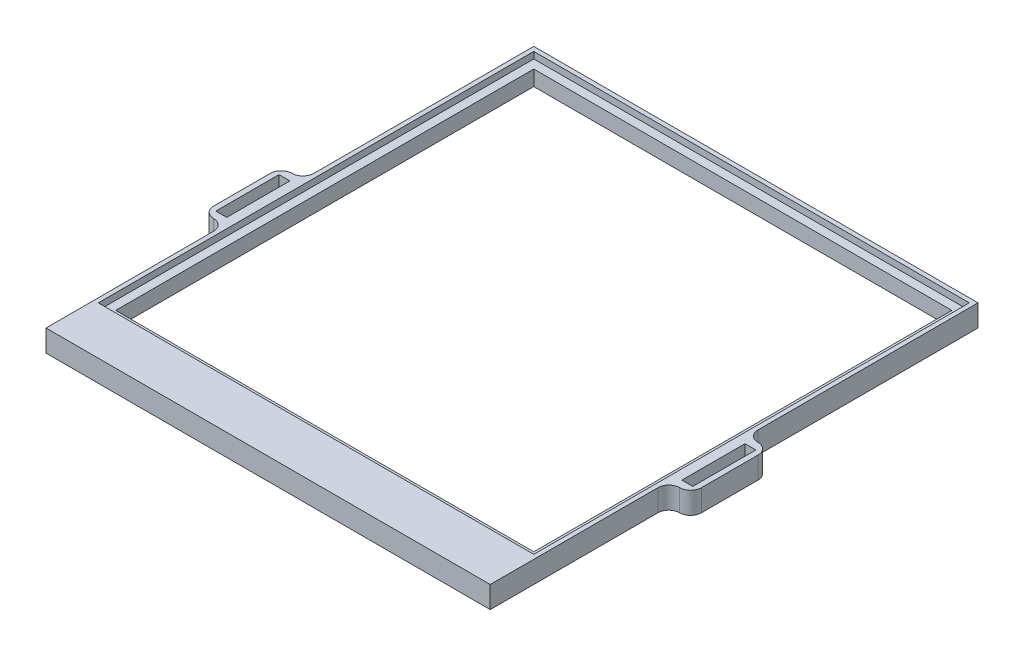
ISO-10303-21;
HEADER;
FILE_DESCRIPTION(('STEP AP214'),'2;1');
FILE_NAME('part.step','',(''),(''),'','','');
FILE_SCHEMA(('AUTOMOTIVE_DESIGN { 1 0 10303 214 1 1 1 1 }'));
ENDSEC;
DATA;
#1=APPLICATION_CONTEXT('core data for automotive mechanical design processes');
#2=APPLICATION_PROTOCOL_DEFINITION('international standard','automotive_design',2000,#1);
#3=PRODUCT_CONTEXT('',#1,'mechanical');
#4=PRODUCT('Part','Part','',(#3));
#5=PRODUCT_RELATED_PRODUCT_CATEGORY('part','',(#4));
#6=PRODUCT_DEFINITION_FORMATION('','',#4);
#7=PRODUCT_DEFINITION_CONTEXT('part definition',#1,'design');
#8=PRODUCT_DEFINITION('design','',#6,#7);
#9=PRODUCT_DEFINITION_SHAPE('','',#8);
#10=(LENGTH_UNIT() NAMED_UNIT(*) SI_UNIT(.MILLI.,.METRE.));
#11=(NAMED_UNIT(*) PLANE_ANGLE_UNIT() SI_UNIT($,.RADIAN.));
#12=(NAMED_UNIT(*) SI_UNIT($,.STERADIAN.) SOLID_ANGLE_UNIT());
#13=UNCERTAINTY_MEASURE_WITH_UNIT(LENGTH_MEASURE(1.E-05),#10,'distance_accuracy_value','');
#14=(GEOMETRIC_REPRESENTATION_CONTEXT(3) GLOBAL_UNCERTAINTY_ASSIGNED_CONTEXT((#13)) GLOBAL_UNIT_ASSIGNED_CONTEXT((#10,
#11,#12)) REPRESENTATION_CONTEXT('',''));
#15=CARTESIAN_POINT('',(0.,0.,0.));
#16=DIRECTION('',(0.,0.,1.));
#17=DIRECTION('',(1.,0.,0.));
#18=AXIS2_PLACEMENT_3D('',#15,#16,#17);
#19=CARTESIAN_POINT('',(51.,5.,-51.));
#20=DIRECTION('',(-1.,0.,0.));
#21=DIRECTION('',(0.,0.,1.));
#22=AXIS2_PLACEMENT_3D('',#19,#20,#21);
#23=PLANE('',#22);
#24=DIRECTION('',(0.,0.,-1.));
#25=VECTOR('',#24,1.);
#26=CARTESIAN_POINT('',(51.,0.,-51.));
#27=LINE('',#26,#25);
#28=CARTESIAN_POINT('',(51.,0.,61.));
#29=VERTEX_POINT('',#28);
#30=CARTESIAN_POINT('',(51.,0.,22.5));
#31=VERTEX_POINT('',#30);
#32=EDGE_CURVE('E455',#29,#31,#27,.T.);
#33=ORIENTED_EDGE('',*,*,#32,.T.);
#34=DIRECTION('',(0.,-1.,0.));
#35=VECTOR('',#34,1.);
#36=CARTESIAN_POINT('',(51.,5.,22.5));
#37=LINE('',#36,#35);
#38=CARTESIAN_POINT('',(51.,5.,22.5));
#39=VERTEX_POINT('',#38);
#40=EDGE_CURVE('E519',#31,#39,#37,.F.);
#41=ORIENTED_EDGE('',*,*,#40,.T.);
#42=DIRECTION('',(0.,0.,-1.));
#43=VECTOR('',#42,1.);
#44=CARTESIAN_POINT('',(51.,5.,-51.));
#45=LINE('',#44,#43);
#46=CARTESIAN_POINT('',(51.,5.,61.));
#47=VERTEX_POINT('',#46);
#48=EDGE_CURVE('E438',#47,#39,#45,.T.);
#49=ORIENTED_EDGE('',*,*,#48,.F.);
#50=DIRECTION('',(0.,-1.,0.));
#51=VECTOR('',#50,1.);
#52=CARTESIAN_POINT('',(51.,5.,61.));
#53=LINE('',#52,#51);
#54=EDGE_CURVE('E477',#47,#29,#53,.T.);
#55=ORIENTED_EDGE('',*,*,#54,.T.);
#56=EDGE_LOOP('',(#33,#41,#49,#55));
#57=FACE_BOUND('',#56,.T.);
#58=ADVANCED_FACE('F48',(#57),#23,.F.);
#59=CARTESIAN_POINT('',(-51.,5.,61.));
#60=DIRECTION('',(1.,0.,0.));
#61=DIRECTION('',(0.,0.,-1.));
#62=AXIS2_PLACEMENT_3D('',#59,#60,#61);
#63=PLANE('',#62);
#64=DIRECTION('',(0.,0.,1.));
#65=VECTOR('',#64,1.);
#66=CARTESIAN_POINT('',(-51.,0.,61.));
#67=LINE('',#66,#65);
#68=CARTESIAN_POINT('',(-51.,0.,-51.));
#69=VERTEX_POINT('',#68);
#70=CARTESIAN_POINT('',(-51.,0.,-0.500000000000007));
#71=VERTEX_POINT('',#70);
#72=EDGE_CURVE('E437',#69,#71,#67,.T.);
#73=ORIENTED_EDGE('',*,*,#72,.T.);
#74=DIRECTION('',(0.,-1.,0.));
#75=VECTOR('',#74,1.);
#76=CARTESIAN_POINT('',(-51.,5.,-0.500000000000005));
#77=LINE('',#76,#75);
#78=CARTESIAN_POINT('',(-51.,5.,-0.500000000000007));
#79=VERTEX_POINT('',#78);
#80=EDGE_CURVE('E522',#71,#79,#77,.F.);
#81=ORIENTED_EDGE('',*,*,#80,.T.);
#82=DIRECTION('',(0.,0.,1.));
#83=VECTOR('',#82,1.);
#84=CARTESIAN_POINT('',(-51.,5.,61.));
#85=LINE('',#84,#83);
#86=CARTESIAN_POINT('',(-51.,5.,-51.));
#87=VERTEX_POINT('',#86);
#88=EDGE_CURVE('E446',#87,#79,#85,.T.);
#89=ORIENTED_EDGE('',*,*,#88,.F.);
#90=DIRECTION('',(0.,-1.,0.));
#91=VECTOR('',#90,1.);
#92=CARTESIAN_POINT('',(-51.,5.,-51.));
#93=LINE('',#92,#91);
#94=EDGE_CURVE('E469',#87,#69,#93,.T.);
#95=ORIENTED_EDGE('',*,*,#94,.T.);
#96=EDGE_LOOP('',(#73,#81,#89,#95));
#97=FACE_BOUND('',#96,.T.);
#98=ADVANCED_FACE('F706',(#97),#63,.F.);
#99=CARTESIAN_POINT('',(48.,5.,48.));
#100=DIRECTION('',(-1.,0.,0.));
#101=DIRECTION('',(0.,0.,1.));
#102=AXIS2_PLACEMENT_3D('',#99,#100,#101);
#103=PLANE('',#102);
#104=DIRECTION('',(0.,-1.,0.));
#105=VECTOR('',#104,1.);
#106=CARTESIAN_POINT('',(48.,5.,48.));
#107=LINE('',#106,#105);
#108=CARTESIAN_POINT('',(48.,3.5,48.));
#109=VERTEX_POINT('',#108);
#110=CARTESIAN_POINT('',(48.,0.,48.));
#111=VERTEX_POINT('',#110);
#112=EDGE_CURVE('E419',#109,#111,#107,.T.);
#113=ORIENTED_EDGE('',*,*,#112,.F.);
#114=DIRECTION('',(0.,0.,-1.));
#115=VECTOR('',#114,1.);
#116=CARTESIAN_POINT('',(48.,3.5,48.));
#117=LINE('',#116,#115);
#118=CARTESIAN_POINT('',(48.,3.5,-48.));
#119=VERTEX_POINT('',#118);
#120=EDGE_CURVE('E399',#109,#119,#117,.T.);
#121=ORIENTED_EDGE('',*,*,#120,.T.);
#122=DIRECTION('',(0.,-1.,0.));
#123=VECTOR('',#122,1.);
#124=CARTESIAN_POINT('',(48.,5.,-48.));
#125=LINE('',#124,#123);
#126=CARTESIAN_POINT('',(48.,0.,-48.));
#127=VERTEX_POINT('',#126);
#128=EDGE_CURVE('E428',#119,#127,#125,.T.);
#129=ORIENTED_EDGE('',*,*,#128,.T.);
#130=DIRECTION('',(0.,0.,-1.));
#131=VECTOR('',#130,1.);
#132=CARTESIAN_POINT('',(48.,0.,48.));
#133=LINE('',#132,#131);
#134=EDGE_CURVE('E403',#111,#127,#133,.T.);
#135=ORIENTED_EDGE('',*,*,#134,.F.);
#136=EDGE_LOOP('',(#113,#121,#129,#135));
#137=FACE_BOUND('',#136,.T.);
#138=ADVANCED_FACE('F713',(#137),#103,.T.);
#139=CARTESIAN_POINT('',(-48.,5.,-48.));
#140=DIRECTION('',(0.,0.,1.));
#141=DIRECTION('',(1.,0.,0.));
#142=AXIS2_PLACEMENT_3D('',#139,#140,#141);
#143=PLANE('',#142);
#144=ORIENTED_EDGE('',*,*,#128,.F.);
#145=DIRECTION('',(-1.,0.,0.));
#146=VECTOR('',#145,1.);
#147=CARTESIAN_POINT('',(-48.,3.5,-48.));
#148=LINE('',#147,#146);
#149=CARTESIAN_POINT('',(-48.,3.5,-48.));
#150=VERTEX_POINT('',#149);
#151=EDGE_CURVE('E395',#119,#150,#148,.T.);
#152=ORIENTED_EDGE('',*,*,#151,.T.);
#153=DIRECTION('',(0.,-1.,0.));
#154=VECTOR('',#153,1.);
#155=CARTESIAN_POINT('',(-48.,5.,-48.));
#156=LINE('',#155,#154);
#157=CARTESIAN_POINT('',(-48.,0.,-48.));
#158=VERTEX_POINT('',#157);
#159=EDGE_CURVE('E425',#150,#158,#156,.T.);
#160=ORIENTED_EDGE('',*,*,#159,.T.);
#161=DIRECTION('',(-1.,0.,0.));
#162=VECTOR('',#161,1.);
#163=CARTESIAN_POINT('',(-48.,0.,-48.));
#164=LINE('',#163,#162);
#165=EDGE_CURVE('E407',#127,#158,#164,.T.);
#166=ORIENTED_EDGE('',*,*,#165,.F.);
#167=EDGE_LOOP('',(#144,#152,#160,#166));
#168=FACE_BOUND('',#167,.T.);
#169=ADVANCED_FACE('F1142',(#168),#143,.T.);
#170=CARTESIAN_POINT('',(-48.,5.,48.));
#171=DIRECTION('',(1.,0.,0.));
#172=DIRECTION('',(0.,0.,-1.));
#173=AXIS2_PLACEMENT_3D('',#170,#171,#172);
#174=PLANE('',#173);
#175=ORIENTED_EDGE('',*,*,#159,.F.);
#176=DIRECTION('',(0.,0.,1.));
#177=VECTOR('',#176,1.);
#178=CARTESIAN_POINT('',(-48.,3.5,48.));
#179=LINE('',#178,#177);
#180=CARTESIAN_POINT('',(-48.,3.5,48.));
#181=VERTEX_POINT('',#180);
#182=EDGE_CURVE('E382',#150,#181,#179,.T.);
#183=ORIENTED_EDGE('',*,*,#182,.T.);
#184=DIRECTION('',(0.,-1.,0.));
#185=VECTOR('',#184,1.);
#186=CARTESIAN_POINT('',(-48.,5.,48.));
#187=LINE('',#186,#185);
#188=CARTESIAN_POINT('',(-48.,0.,48.));
#189=VERTEX_POINT('',#188);
#190=EDGE_CURVE('E422',#181,#189,#187,.T.);
#191=ORIENTED_EDGE('',*,*,#190,.T.);
#192=DIRECTION('',(0.,0.,1.));
#193=VECTOR('',#192,1.);
#194=CARTESIAN_POINT('',(-48.,0.,48.));
#195=LINE('',#194,#193);
#196=EDGE_CURVE('E411',#158,#189,#195,.T.);
#197=ORIENTED_EDGE('',*,*,#196,.F.);
#198=EDGE_LOOP('',(#175,#183,#191,#197));
#199=FACE_BOUND('',#198,.T.);
#200=ADVANCED_FACE('F1133',(#199),#174,.T.);
#201=CARTESIAN_POINT('',(-48.,5.,48.));
#202=DIRECTION('',(0.,0.,-1.));
#203=DIRECTION('',(-1.,0.,0.));
#204=AXIS2_PLACEMENT_3D('',#201,#202,#203);
#205=PLANE('',#204);
#206=ORIENTED_EDGE('',*,*,#190,.F.);
#207=DIRECTION('',(1.,0.,0.));
#208=VECTOR('',#207,1.);
#209=CARTESIAN_POINT('',(-48.,3.5,48.));
#210=LINE('',#209,#208);
#211=EDGE_CURVE('E481',#181,#109,#210,.T.);
#212=ORIENTED_EDGE('',*,*,#211,.T.);
#213=ORIENTED_EDGE('',*,*,#112,.T.);
#214=DIRECTION('',(1.,0.,0.));
#215=VECTOR('',#214,1.);
#216=CARTESIAN_POINT('',(-48.,0.,48.));
#217=LINE('',#216,#215);
#218=EDGE_CURVE('E415',#189,#111,#217,.T.);
#219=ORIENTED_EDGE('',*,*,#218,.F.);
#220=EDGE_LOOP('',(#206,#212,#213,#219));
#221=FACE_BOUND('',#220,.T.);
#222=ADVANCED_FACE('F992',(#221),#205,.T.);
#223=CARTESIAN_POINT('',(0.,5.,0.));
#224=DIRECTION('',(0.,-1.,0.));
#225=DIRECTION('',(0.,0.,-1.));
#226=AXIS2_PLACEMENT_3D('',#223,#224,#225);
#227=PLANE('',#226);
#228=DIRECTION('',(-1.,0.,0.));
#229=VECTOR('',#228,1.);
#230=CARTESIAN_POINT('',(0.,5.,-50.));
#231=LINE('',#230,#229);
#232=CARTESIAN_POINT('',(50.,5.,-50.));
#233=VERTEX_POINT('',#232);
#234=CARTESIAN_POINT('',(-50.,5.,-50.));
#235=VERTEX_POINT('',#234);
#236=EDGE_CURVE('E368',#233,#235,#231,.T.);
#237=ORIENTED_EDGE('',*,*,#236,.F.);
#238=DIRECTION('',(0.,0.,-1.));
#239=VECTOR('',#238,1.);
#240=CARTESIAN_POINT('',(50.,5.,0.));
#241=LINE('',#240,#239);
#242=CARTESIAN_POINT('',(50.,5.,50.));
#243=VERTEX_POINT('',#242);
#244=EDGE_CURVE('E345',#243,#233,#241,.T.);
#245=ORIENTED_EDGE('',*,*,#244,.F.);
#246=DIRECTION('',(1.,0.,0.));
#247=VECTOR('',#246,1.);
#248=CARTESIAN_POINT('',(0.,5.,50.));
#249=LINE('',#248,#247);
#250=CARTESIAN_POINT('',(-50.,5.,50.));
#251=VERTEX_POINT('',#250);
#252=EDGE_CURVE('E353',#251,#243,#249,.T.);
#253=ORIENTED_EDGE('',*,*,#252,.F.);
#254=DIRECTION('',(0.,0.,1.));
#255=VECTOR('',#254,1.);
#256=CARTESIAN_POINT('',(-50.,5.,0.));
#257=LINE('',#256,#255);
#258=EDGE_CURVE('E372',#235,#251,#257,.T.);
#259=ORIENTED_EDGE('',*,*,#258,.F.);
#260=EDGE_LOOP('',(#237,#245,#253,#259));
#261=FACE_BOUND('',#260,.T.);
#262=DIRECTION('',(0.,0.,1.));
#263=VECTOR('',#262,1.);
#264=CARTESIAN_POINT('',(56.,5.,1.99999999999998));
#265=LINE('',#264,#263);
#266=CARTESIAN_POINT('',(56.,5.,4.49999999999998));
#267=VERTEX_POINT('',#266);
#268=CARTESIAN_POINT('',(56.,5.,17.5));
#269=VERTEX_POINT('',#268);
#270=EDGE_CURVE('E295',#267,#269,#265,.T.);
#271=ORIENTED_EDGE('',*,*,#270,.F.);
#272=CARTESIAN_POINT('',(53.5,5.,4.49999999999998));
#273=DIRECTION('',(0.,-1.,0.));
#274=DIRECTION('',(0.,0.,-1.));
#275=AXIS2_PLACEMENT_3D('',#272,#273,#274);
#276=CIRCLE('',#275,2.5);
#277=CARTESIAN_POINT('',(53.5,5.,1.99999999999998));
#278=VERTEX_POINT('',#277);
#279=EDGE_CURVE('E516',#267,#278,#276,.F.);
#280=ORIENTED_EDGE('',*,*,#279,.T.);
#281=CARTESIAN_POINT('',(53.5,5.,-0.500000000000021));
#282=DIRECTION('',(0.,-1.,0.));
#283=DIRECTION('',(0.,0.,-1.));
#284=AXIS2_PLACEMENT_3D('',#281,#282,#283);
#285=CIRCLE('',#284,2.5);
#286=CARTESIAN_POINT('',(51.,5.,-0.500000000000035));
#287=VERTEX_POINT('',#286);
#288=EDGE_CURVE('E539',#278,#287,#285,.T.);
#289=ORIENTED_EDGE('',*,*,#288,.T.);
#290=CARTESIAN_POINT('',(51.,5.,-51.));
#291=VERTEX_POINT('',#290);
#292=EDGE_CURVE('E436',#287,#291,#45,.T.);
#293=ORIENTED_EDGE('',*,*,#292,.T.);
#294=DIRECTION('',(-1.,0.,0.));
#295=VECTOR('',#294,1.);
#296=CARTESIAN_POINT('',(-51.,5.,-51.));
#297=LINE('',#296,#295);
#298=EDGE_CURVE('E442',#291,#87,#297,.T.);
#299=ORIENTED_EDGE('',*,*,#298,.T.);
#300=ORIENTED_EDGE('',*,*,#88,.T.);
#301=CARTESIAN_POINT('',(-53.5,5.,-0.500000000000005));
#302=DIRECTION('',(0.,-1.,0.));
#303=DIRECTION('',(0.,0.,-1.));
#304=AXIS2_PLACEMENT_3D('',#301,#302,#303);
#305=CIRCLE('',#304,2.5);
#306=CARTESIAN_POINT('',(-53.5,5.,1.99999999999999));
#307=VERTEX_POINT('',#306);
#308=EDGE_CURVE('E551',#79,#307,#305,.T.);
#309=ORIENTED_EDGE('',*,*,#308,.T.);
#310=CARTESIAN_POINT('',(-53.5,5.,4.49999999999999));
#311=DIRECTION('',(0.,-1.,0.));
#312=DIRECTION('',(0.,0.,-1.));
#313=AXIS2_PLACEMENT_3D('',#310,#311,#312);
#314=CIRCLE('',#313,2.5);
#315=CARTESIAN_POINT('',(-56.,5.,4.49999999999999));
#316=VERTEX_POINT('',#315);
#317=EDGE_CURVE('E510',#307,#316,#314,.F.);
#318=ORIENTED_EDGE('',*,*,#317,.T.);
#319=DIRECTION('',(0.,0.,-1.));
#320=VECTOR('',#319,1.);
#321=CARTESIAN_POINT('',(-56.,5.,1.99999999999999));
#322=LINE('',#321,#320);
#323=CARTESIAN_POINT('',(-56.,5.,17.5));
#324=VERTEX_POINT('',#323);
#325=EDGE_CURVE('E305',#324,#316,#322,.T.);
#326=ORIENTED_EDGE('',*,*,#325,.F.);
#327=CARTESIAN_POINT('',(-53.5,5.,17.5));
#328=DIRECTION('',(0.,-1.,0.));
#329=DIRECTION('',(0.,0.,-1.));
#330=AXIS2_PLACEMENT_3D('',#327,#328,#329);
#331=CIRCLE('',#330,2.5);
#332=CARTESIAN_POINT('',(-53.5,5.,20.));
#333=VERTEX_POINT('',#332);
#334=EDGE_CURVE('E69',#324,#333,#331,.F.);
#335=ORIENTED_EDGE('',*,*,#334,.T.);
#336=CARTESIAN_POINT('',(-53.5,5.,22.5));
#337=DIRECTION('',(0.,-1.,0.));
#338=DIRECTION('',(0.,0.,-1.));
#339=AXIS2_PLACEMENT_3D('',#336,#337,#338);
#340=CIRCLE('',#339,2.5);
#341=CARTESIAN_POINT('',(-51.,5.,22.5));
#342=VERTEX_POINT('',#341);
#343=EDGE_CURVE('E11',#333,#342,#340,.T.);
#344=ORIENTED_EDGE('',*,*,#343,.T.);
#345=CARTESIAN_POINT('',(-51.,5.,61.));
#346=VERTEX_POINT('',#345);
#347=EDGE_CURVE('E445',#342,#346,#85,.T.);
#348=ORIENTED_EDGE('',*,*,#347,.T.);
#349=DIRECTION('',(1.,0.,0.));
#350=VECTOR('',#349,1.);
#351=CARTESIAN_POINT('',(51.,5.,61.));
#352=LINE('',#351,#350);
#353=EDGE_CURVE('E432',#346,#47,#352,.T.);
#354=ORIENTED_EDGE('',*,*,#353,.T.);
#355=ORIENTED_EDGE('',*,*,#48,.T.);
#356=CARTESIAN_POINT('',(53.5,5.,22.5));
#357=DIRECTION('',(0.,-1.,0.));
#358=DIRECTION('',(0.,0.,-1.));
#359=AXIS2_PLACEMENT_3D('',#356,#357,#358);
#360=CIRCLE('',#359,2.5);
#361=CARTESIAN_POINT('',(53.5,5.,20.));
#362=VERTEX_POINT('',#361);
#363=EDGE_CURVE('E545',#39,#362,#360,.T.);
#364=ORIENTED_EDGE('',*,*,#363,.T.);
#365=CARTESIAN_POINT('',(53.5,5.,17.5));
#366=DIRECTION('',(0.,-1.,0.));
#367=DIRECTION('',(0.,0.,-1.));
#368=AXIS2_PLACEMENT_3D('',#365,#366,#367);
#369=CIRCLE('',#368,2.5);
#370=EDGE_CURVE('E513',#362,#269,#369,.F.);
#371=ORIENTED_EDGE('',*,*,#370,.T.);
#372=EDGE_LOOP('',(#271,#280,#289,#293,#299,#300,#309,#318,#326,#335,#344,#348,#354,#355,#364,#371));
#373=FACE_BOUND('',#372,.T.);
#374=DIRECTION('',(0.,0.,-1.));
#375=VECTOR('',#374,1.);
#376=CARTESIAN_POINT('',(-54.75,5.,18.25));
#377=LINE('',#376,#375);
#378=CARTESIAN_POINT('',(-54.75,5.,18.25));
#379=VERTEX_POINT('',#378);
#380=CARTESIAN_POINT('',(-54.75,5.00000000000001,3.75));
#381=VERTEX_POINT('',#380);
#382=EDGE_CURVE('E325',#379,#381,#377,.T.);
#383=ORIENTED_EDGE('',*,*,#382,.T.);
#384=DIRECTION('',(1.,0.,0.));
#385=VECTOR('',#384,1.);
#386=CARTESIAN_POINT('',(-54.75,5.,3.75));
#387=LINE('',#386,#385);
#388=CARTESIAN_POINT('',(-52.25,5.,3.75000000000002));
#389=VERTEX_POINT('',#388);
#390=EDGE_CURVE('E321',#381,#389,#387,.T.);
#391=ORIENTED_EDGE('',*,*,#390,.T.);
#392=DIRECTION('',(0.,0.,1.));
#393=VECTOR('',#392,1.);
#394=CARTESIAN_POINT('',(-52.25,5.,18.25));
#395=LINE('',#394,#393);
#396=CARTESIAN_POINT('',(-52.25,5.,18.25));
#397=VERTEX_POINT('',#396);
#398=EDGE_CURVE('E324',#389,#397,#395,.T.);
#399=ORIENTED_EDGE('',*,*,#398,.T.);
#400=DIRECTION('',(-1.,0.,0.));
#401=VECTOR('',#400,1.);
#402=CARTESIAN_POINT('',(-54.75,5.,18.25));
#403=LINE('',#402,#401);
#404=EDGE_CURVE('E342',#397,#379,#403,.T.);
#405=ORIENTED_EDGE('',*,*,#404,.T.);
#406=EDGE_LOOP('',(#383,#391,#399,#405));
#407=FACE_BOUND('',#406,.T.);
#408=DIRECTION('',(-1.,0.,0.));
#409=VECTOR('',#408,1.);
#410=CARTESIAN_POINT('',(54.75,5.,18.25));
#411=LINE('',#410,#409);
#412=CARTESIAN_POINT('',(54.75,5.,18.25));
#413=VERTEX_POINT('',#412);
#414=CARTESIAN_POINT('',(52.25,5.00000000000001,18.25));
#415=VERTEX_POINT('',#414);
#416=EDGE_CURVE('E264',#413,#415,#411,.T.);
#417=ORIENTED_EDGE('',*,*,#416,.T.);
#418=DIRECTION('',(0.,0.,-1.));
#419=VECTOR('',#418,1.);
#420=CARTESIAN_POINT('',(52.25,5.,18.25));
#421=LINE('',#420,#419);
#422=CARTESIAN_POINT('',(52.25,5.,3.75000000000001));
#423=VERTEX_POINT('',#422);
#424=EDGE_CURVE('E292',#415,#423,#421,.T.);
#425=ORIENTED_EDGE('',*,*,#424,.T.);
#426=DIRECTION('',(1.,0.,0.));
#427=VECTOR('',#426,1.);
#428=CARTESIAN_POINT('',(54.75,5.,3.75000000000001));
#429=LINE('',#428,#427);
#430=CARTESIAN_POINT('',(54.75,5.,3.75000000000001));
#431=VERTEX_POINT('',#430);
#432=EDGE_CURVE('E671',#423,#431,#429,.T.);
#433=ORIENTED_EDGE('',*,*,#432,.T.);
#434=DIRECTION('',(0.,0.,1.));
#435=VECTOR('',#434,1.);
#436=CARTESIAN_POINT('',(54.75,5.,18.25));
#437=LINE('',#436,#435);
#438=EDGE_CURVE('E560',#431,#413,#437,.T.);
#439=ORIENTED_EDGE('',*,*,#438,.T.);
#440=EDGE_LOOP('',(#417,#425,#433,#439));
#441=FACE_BOUND('',#440,.T.);
#442=ADVANCED_FACE('F685',(#261,#373,#407,#441),#227,.F.);
#443=CARTESIAN_POINT('',(0.,0.,0.));
#444=DIRECTION('',(0.,-1.,0.));
#445=DIRECTION('',(0.,0.,-1.));
#446=AXIS2_PLACEMENT_3D('',#443,#444,#445);
#447=PLANE('',#446);
#448=CARTESIAN_POINT('',(51.,0.,-0.500000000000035));
#449=VERTEX_POINT('',#448);
#450=CARTESIAN_POINT('',(51.,0.,-51.));
#451=VERTEX_POINT('',#450);
#452=EDGE_CURVE('E454',#449,#451,#27,.T.);
#453=ORIENTED_EDGE('',*,*,#452,.F.);
#454=CARTESIAN_POINT('',(53.5,0.,-0.500000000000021));
#455=DIRECTION('',(0.,-1.,0.));
#456=DIRECTION('',(0.,0.,-1.));
#457=AXIS2_PLACEMENT_3D('',#454,#455,#456);
#458=CIRCLE('',#457,2.5);
#459=CARTESIAN_POINT('',(53.5,0.,1.99999999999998));
#460=VERTEX_POINT('',#459);
#461=EDGE_CURVE('E536',#449,#460,#458,.F.);
#462=ORIENTED_EDGE('',*,*,#461,.T.);
#463=CARTESIAN_POINT('',(53.5,0.,4.49999999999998));
#464=DIRECTION('',(0.,-1.,0.));
#465=DIRECTION('',(0.,0.,-1.));
#466=AXIS2_PLACEMENT_3D('',#463,#464,#465);
#467=CIRCLE('',#466,2.5);
#468=CARTESIAN_POINT('',(56.,0.,4.49999999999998));
#469=VERTEX_POINT('',#468);
#470=EDGE_CURVE('E498',#460,#469,#467,.T.);
#471=ORIENTED_EDGE('',*,*,#470,.T.);
#472=DIRECTION('',(0.,0.,-1.));
#473=VECTOR('',#472,1.);
#474=CARTESIAN_POINT('',(56.,0.,1.99999999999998));
#475=LINE('',#474,#473);
#476=CARTESIAN_POINT('',(56.,0.,17.5));
#477=VERTEX_POINT('',#476);
#478=EDGE_CURVE('E268',#477,#469,#475,.T.);
#479=ORIENTED_EDGE('',*,*,#478,.F.);
#480=CARTESIAN_POINT('',(53.5,0.,17.5));
#481=DIRECTION('',(0.,-1.,0.));
#482=DIRECTION('',(0.,0.,-1.));
#483=AXIS2_PLACEMENT_3D('',#480,#481,#482);
#484=CIRCLE('',#483,2.5);
#485=CARTESIAN_POINT('',(53.5,0.,20.));
#486=VERTEX_POINT('',#485);
#487=EDGE_CURVE('E495',#477,#486,#484,.T.);
#488=ORIENTED_EDGE('',*,*,#487,.T.);
#489=CARTESIAN_POINT('',(53.5,0.,22.5));
#490=DIRECTION('',(0.,-1.,0.));
#491=DIRECTION('',(0.,0.,-1.));
#492=AXIS2_PLACEMENT_3D('',#489,#490,#491);
#493=CIRCLE('',#492,2.5);
#494=EDGE_CURVE('E542',#486,#31,#493,.F.);
#495=ORIENTED_EDGE('',*,*,#494,.T.);
#496=ORIENTED_EDGE('',*,*,#32,.F.);
#497=DIRECTION('',(1.,0.,0.));
#498=VECTOR('',#497,1.);
#499=CARTESIAN_POINT('',(51.,0.,61.));
#500=LINE('',#499,#498);
#501=CARTESIAN_POINT('',(-51.,0.,61.));
#502=VERTEX_POINT('',#501);
#503=EDGE_CURVE('E431',#502,#29,#500,.T.);
#504=ORIENTED_EDGE('',*,*,#503,.F.);
#505=CARTESIAN_POINT('',(-51.,0.,22.5));
#506=VERTEX_POINT('',#505);
#507=EDGE_CURVE('E462',#506,#502,#67,.T.);
#508=ORIENTED_EDGE('',*,*,#507,.F.);
#509=CARTESIAN_POINT('',(-53.5,0.,22.5));
#510=DIRECTION('',(0.,-1.,0.));
#511=DIRECTION('',(0.,0.,-1.));
#512=AXIS2_PLACEMENT_3D('',#509,#510,#511);
#513=CIRCLE('',#512,2.5);
#514=CARTESIAN_POINT('',(-53.5,0.,20.));
#515=VERTEX_POINT('',#514);
#516=EDGE_CURVE('E58',#506,#515,#513,.F.);
#517=ORIENTED_EDGE('',*,*,#516,.T.);
#518=CARTESIAN_POINT('',(-53.5,0.,17.5));
#519=DIRECTION('',(0.,-1.,0.));
#520=DIRECTION('',(0.,0.,-1.));
#521=AXIS2_PLACEMENT_3D('',#518,#519,#520);
#522=CIRCLE('',#521,2.5);
#523=CARTESIAN_POINT('',(-56.,0.,17.5));
#524=VERTEX_POINT('',#523);
#525=EDGE_CURVE('E489',#515,#524,#522,.T.);
#526=ORIENTED_EDGE('',*,*,#525,.T.);
#527=DIRECTION('',(0.,0.,1.));
#528=VECTOR('',#527,1.);
#529=CARTESIAN_POINT('',(-56.,0.,1.99999999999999));
#530=LINE('',#529,#528);
#531=CARTESIAN_POINT('',(-56.,0.,4.49999999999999));
#532=VERTEX_POINT('',#531);
#533=EDGE_CURVE('E300',#532,#524,#530,.T.);
#534=ORIENTED_EDGE('',*,*,#533,.F.);
#535=CARTESIAN_POINT('',(-53.5,0.,4.49999999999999));
#536=DIRECTION('',(0.,-1.,0.));
#537=DIRECTION('',(0.,0.,-1.));
#538=AXIS2_PLACEMENT_3D('',#535,#536,#537);
#539=CIRCLE('',#538,2.5);
#540=CARTESIAN_POINT('',(-53.5,0.,1.99999999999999));
#541=VERTEX_POINT('',#540);
#542=EDGE_CURVE('E492',#532,#541,#539,.T.);
#543=ORIENTED_EDGE('',*,*,#542,.T.);
#544=CARTESIAN_POINT('',(-53.5,0.,-0.500000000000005));
#545=DIRECTION('',(0.,-1.,0.));
#546=DIRECTION('',(0.,0.,-1.));
#547=AXIS2_PLACEMENT_3D('',#544,#545,#546);
#548=CIRCLE('',#547,2.5);
#549=EDGE_CURVE('E548',#541,#71,#548,.F.);
#550=ORIENTED_EDGE('',*,*,#549,.T.);
#551=ORIENTED_EDGE('',*,*,#72,.F.);
#552=DIRECTION('',(-1.,0.,0.));
#553=VECTOR('',#552,1.);
#554=CARTESIAN_POINT('',(-51.,0.,-51.));
#555=LINE('',#554,#553);
#556=EDGE_CURVE('E459',#451,#69,#555,.T.);
#557=ORIENTED_EDGE('',*,*,#556,.F.);
#558=EDGE_LOOP('',(#453,#462,#471,#479,#488,#495,#496,#504,#508,#517,#526,#534,#543,#550,#551,#557));
#559=FACE_BOUND('',#558,.T.);
#560=ORIENTED_EDGE('',*,*,#218,.T.);
#561=ORIENTED_EDGE('',*,*,#134,.T.);
#562=ORIENTED_EDGE('',*,*,#165,.T.);
#563=ORIENTED_EDGE('',*,*,#196,.T.);
#564=EDGE_LOOP('',(#560,#561,#562,#563));
#565=FACE_BOUND('',#564,.T.);
#566=DIRECTION('',(0.,0.,1.));
#567=VECTOR('',#566,1.);
#568=CARTESIAN_POINT('',(-54.75,0.,18.25));
#569=LINE('',#568,#567);
#570=CARTESIAN_POINT('',(-54.75,0.,3.75));
#571=VERTEX_POINT('',#570);
#572=CARTESIAN_POINT('',(-54.75,0.,18.25));
#573=VERTEX_POINT('',#572);
#574=EDGE_CURVE('E289',#571,#573,#569,.T.);
#575=ORIENTED_EDGE('',*,*,#574,.T.);
#576=DIRECTION('',(1.,0.,0.));
#577=VECTOR('',#576,1.);
#578=CARTESIAN_POINT('',(-54.75,0.,18.25));
#579=LINE('',#578,#577);
#580=CARTESIAN_POINT('',(-52.25,0.,18.25));
#581=VERTEX_POINT('',#580);
#582=EDGE_CURVE('E314',#573,#581,#579,.T.);
#583=ORIENTED_EDGE('',*,*,#582,.T.);
#584=DIRECTION('',(0.,0.,-1.));
#585=VECTOR('',#584,1.);
#586=CARTESIAN_POINT('',(-52.25,0.,18.25));
#587=LINE('',#586,#585);
#588=CARTESIAN_POINT('',(-52.25,0.,3.75000000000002));
#589=VERTEX_POINT('',#588);
#590=EDGE_CURVE('E310',#581,#589,#587,.T.);
#591=ORIENTED_EDGE('',*,*,#590,.T.);
#592=DIRECTION('',(-1.,0.,0.));
#593=VECTOR('',#592,1.);
#594=CARTESIAN_POINT('',(-54.75,0.,3.75));
#595=LINE('',#594,#593);
#596=EDGE_CURVE('E306',#589,#571,#595,.T.);
#597=ORIENTED_EDGE('',*,*,#596,.T.);
#598=EDGE_LOOP('',(#575,#583,#591,#597));
#599=FACE_BOUND('',#598,.T.);
#600=DIRECTION('',(0.,0.,1.));
#601=VECTOR('',#600,1.);
#602=CARTESIAN_POINT('',(52.25,0.,18.25));
#603=LINE('',#602,#601);
#604=CARTESIAN_POINT('',(52.25,0.,3.75000000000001));
#605=VERTEX_POINT('',#604);
#606=CARTESIAN_POINT('',(52.25,0.,18.25));
#607=VERTEX_POINT('',#606);
#608=EDGE_CURVE('E283',#605,#607,#603,.T.);
#609=ORIENTED_EDGE('',*,*,#608,.T.);
#610=DIRECTION('',(1.,0.,0.));
#611=VECTOR('',#610,1.);
#612=CARTESIAN_POINT('',(54.75,0.,18.25));
#613=LINE('',#612,#611);
#614=CARTESIAN_POINT('',(54.75,0.,18.25));
#615=VERTEX_POINT('',#614);
#616=EDGE_CURVE('E262',#607,#615,#613,.T.);
#617=ORIENTED_EDGE('',*,*,#616,.T.);
#618=DIRECTION('',(0.,0.,-1.));
#619=VECTOR('',#618,1.);
#620=CARTESIAN_POINT('',(54.75,0.,18.25));
#621=LINE('',#620,#619);
#622=CARTESIAN_POINT('',(54.75,0.,3.75000000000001));
#623=VERTEX_POINT('',#622);
#624=EDGE_CURVE('E272',#615,#623,#621,.T.);
#625=ORIENTED_EDGE('',*,*,#624,.T.);
#626=DIRECTION('',(-1.,0.,0.));
#627=VECTOR('',#626,1.);
#628=CARTESIAN_POINT('',(54.75,0.,3.75000000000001));
#629=LINE('',#628,#627);
#630=EDGE_CURVE('E279',#623,#605,#629,.T.);
#631=ORIENTED_EDGE('',*,*,#630,.T.);
#632=EDGE_LOOP('',(#609,#617,#625,#631));
#633=FACE_BOUND('',#632,.T.);
#634=ADVANCED_FACE('F281',(#559,#565,#599,#633),#447,.T.);
#635=CARTESIAN_POINT('',(51.,5.,61.));
#636=DIRECTION('',(0.,0.,-1.));
#637=DIRECTION('',(-1.,0.,0.));
#638=AXIS2_PLACEMENT_3D('',#635,#636,#637);
#639=PLANE('',#638);
#640=ORIENTED_EDGE('',*,*,#503,.T.);
#641=ORIENTED_EDGE('',*,*,#54,.F.);
#642=ORIENTED_EDGE('',*,*,#353,.F.);
#643=DIRECTION('',(0.,-1.,0.));
#644=VECTOR('',#643,1.);
#645=CARTESIAN_POINT('',(-51.,5.,61.));
#646=LINE('',#645,#644);
#647=EDGE_CURVE('E450',#346,#502,#646,.T.);
#648=ORIENTED_EDGE('',*,*,#647,.T.);
#649=EDGE_LOOP('',(#640,#641,#642,#648));
#650=FACE_BOUND('',#649,.T.);
#651=ADVANCED_FACE('F720',(#650),#639,.F.);
#652=ORIENTED_EDGE('',*,*,#292,.F.);
#653=DIRECTION('',(0.,-1.,0.));
#654=VECTOR('',#653,1.);
#655=CARTESIAN_POINT('',(51.,0.,-0.500000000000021));
#656=LINE('',#655,#654);
#657=EDGE_CURVE('E485',#287,#449,#656,.T.);
#658=ORIENTED_EDGE('',*,*,#657,.T.);
#659=ORIENTED_EDGE('',*,*,#452,.T.);
#660=DIRECTION('',(0.,-1.,0.));
#661=VECTOR('',#660,1.);
#662=CARTESIAN_POINT('',(51.,5.,-51.));
#663=LINE('',#662,#661);
#664=EDGE_CURVE('E473',#291,#451,#663,.T.);
#665=ORIENTED_EDGE('',*,*,#664,.F.);
#666=EDGE_LOOP('',(#652,#658,#659,#665));
#667=FACE_BOUND('',#666,.T.);
#668=ADVANCED_FACE('F709',(#667),#23,.F.);
#669=CARTESIAN_POINT('',(-51.,5.,-51.));
#670=DIRECTION('',(0.,0.,1.));
#671=DIRECTION('',(1.,0.,0.));
#672=AXIS2_PLACEMENT_3D('',#669,#670,#671);
#673=PLANE('',#672);
#674=ORIENTED_EDGE('',*,*,#556,.T.);
#675=ORIENTED_EDGE('',*,*,#94,.F.);
#676=ORIENTED_EDGE('',*,*,#298,.F.);
#677=ORIENTED_EDGE('',*,*,#664,.T.);
#678=EDGE_LOOP('',(#674,#675,#676,#677));
#679=FACE_BOUND('',#678,.T.);
#680=ADVANCED_FACE('F719',(#679),#673,.F.);
#681=ORIENTED_EDGE('',*,*,#347,.F.);
#682=DIRECTION('',(0.,-1.,0.));
#683=VECTOR('',#682,1.);
#684=CARTESIAN_POINT('',(-51.,0.,22.5));
#685=LINE('',#684,#683);
#686=EDGE_CURVE('E533',#342,#506,#685,.T.);
#687=ORIENTED_EDGE('',*,*,#686,.T.);
#688=ORIENTED_EDGE('',*,*,#507,.T.);
#689=ORIENTED_EDGE('',*,*,#647,.F.);
#690=EDGE_LOOP('',(#681,#687,#688,#689));
#691=FACE_BOUND('',#690,.T.);
#692=ADVANCED_FACE('F586',(#691),#63,.F.);
#693=CARTESIAN_POINT('',(50.,3.5,0.));
#694=DIRECTION('',(1.,0.,0.));
#695=DIRECTION('',(0.,0.,-1.));
#696=AXIS2_PLACEMENT_3D('',#693,#694,#695);
#697=PLANE('',#696);
#698=ORIENTED_EDGE('',*,*,#244,.T.);
#699=DIRECTION('',(0.,1.,0.));
#700=VECTOR('',#699,1.);
#701=CARTESIAN_POINT('',(50.,3.5,-50.));
#702=LINE('',#701,#700);
#703=CARTESIAN_POINT('',(50.,3.5,-50.));
#704=VERTEX_POINT('',#703);
#705=EDGE_CURVE('E365',#704,#233,#702,.T.);
#706=ORIENTED_EDGE('',*,*,#705,.F.);
#707=DIRECTION('',(0.,0.,-1.));
#708=VECTOR('',#707,1.);
#709=CARTESIAN_POINT('',(50.,3.5,0.));
#710=LINE('',#709,#708);
#711=CARTESIAN_POINT('',(50.,3.5,50.));
#712=VERTEX_POINT('',#711);
#713=EDGE_CURVE('E348',#712,#704,#710,.T.);
#714=ORIENTED_EDGE('',*,*,#713,.F.);
#715=DIRECTION('',(0.,1.,0.));
#716=VECTOR('',#715,1.);
#717=CARTESIAN_POINT('',(50.,3.5,50.));
#718=LINE('',#717,#716);
#719=EDGE_CURVE('E379',#712,#243,#718,.T.);
#720=ORIENTED_EDGE('',*,*,#719,.T.);
#721=EDGE_LOOP('',(#698,#706,#714,#720));
#722=FACE_BOUND('',#721,.T.);
#723=ADVANCED_FACE('F965',(#722),#697,.F.);
#724=CARTESIAN_POINT('',(0.,3.5,50.));
#725=DIRECTION('',(0.,0.,1.));
#726=DIRECTION('',(1.,0.,0.));
#727=AXIS2_PLACEMENT_3D('',#724,#725,#726);
#728=PLANE('',#727);
#729=ORIENTED_EDGE('',*,*,#252,.T.);
#730=ORIENTED_EDGE('',*,*,#719,.F.);
#731=DIRECTION('',(1.,0.,0.));
#732=VECTOR('',#731,1.);
#733=CARTESIAN_POINT('',(0.,3.5,50.));
#734=LINE('',#733,#732);
#735=CARTESIAN_POINT('',(-50.,3.5,50.));
#736=VERTEX_POINT('',#735);
#737=EDGE_CURVE('E361',#736,#712,#734,.T.);
#738=ORIENTED_EDGE('',*,*,#737,.F.);
#739=DIRECTION('',(0.,1.,0.));
#740=VECTOR('',#739,1.);
#741=CARTESIAN_POINT('',(-50.,3.5,50.));
#742=LINE('',#741,#740);
#743=EDGE_CURVE('E383',#736,#251,#742,.T.);
#744=ORIENTED_EDGE('',*,*,#743,.T.);
#745=EDGE_LOOP('',(#729,#730,#738,#744));
#746=FACE_BOUND('',#745,.T.);
#747=ADVANCED_FACE('F1103',(#746),#728,.F.);
#748=CARTESIAN_POINT('',(-50.,3.5,0.));
#749=DIRECTION('',(-1.,0.,0.));
#750=DIRECTION('',(0.,0.,1.));
#751=AXIS2_PLACEMENT_3D('',#748,#749,#750);
#752=PLANE('',#751);
#753=ORIENTED_EDGE('',*,*,#258,.T.);
#754=ORIENTED_EDGE('',*,*,#743,.F.);
#755=DIRECTION('',(0.,0.,1.));
#756=VECTOR('',#755,1.);
#757=CARTESIAN_POINT('',(-50.,3.5,0.));
#758=LINE('',#757,#756);
#759=CARTESIAN_POINT('',(-50.,3.5,-50.));
#760=VERTEX_POINT('',#759);
#761=EDGE_CURVE('E357',#760,#736,#758,.T.);
#762=ORIENTED_EDGE('',*,*,#761,.F.);
#763=DIRECTION('',(0.,1.,0.));
#764=VECTOR('',#763,1.);
#765=CARTESIAN_POINT('',(-50.,3.5,-50.));
#766=LINE('',#765,#764);
#767=EDGE_CURVE('E386',#760,#235,#766,.T.);
#768=ORIENTED_EDGE('',*,*,#767,.T.);
#769=EDGE_LOOP('',(#753,#754,#762,#768));
#770=FACE_BOUND('',#769,.T.);
#771=ADVANCED_FACE('F1092',(#770),#752,.F.);
#772=CARTESIAN_POINT('',(0.,3.5,-50.));
#773=DIRECTION('',(0.,0.,-1.));
#774=DIRECTION('',(-1.,0.,0.));
#775=AXIS2_PLACEMENT_3D('',#772,#773,#774);
#776=PLANE('',#775);
#777=ORIENTED_EDGE('',*,*,#236,.T.);
#778=ORIENTED_EDGE('',*,*,#767,.F.);
#779=DIRECTION('',(-1.,0.,0.));
#780=VECTOR('',#779,1.);
#781=CARTESIAN_POINT('',(0.,3.5,-50.));
#782=LINE('',#781,#780);
#783=EDGE_CURVE('E352',#704,#760,#782,.T.);
#784=ORIENTED_EDGE('',*,*,#783,.F.);
#785=ORIENTED_EDGE('',*,*,#705,.T.);
#786=EDGE_LOOP('',(#777,#778,#784,#785));
#787=FACE_BOUND('',#786,.T.);
#788=ADVANCED_FACE('F1081',(#787),#776,.F.);
#789=CARTESIAN_POINT('',(0.,3.5,0.));
#790=DIRECTION('',(0.,1.,0.));
#791=DIRECTION('',(0.,0.,1.));
#792=AXIS2_PLACEMENT_3D('',#789,#790,#791);
#793=PLANE('',#792);
#794=ORIENTED_EDGE('',*,*,#211,.F.);
#795=ORIENTED_EDGE('',*,*,#182,.F.);
#796=ORIENTED_EDGE('',*,*,#151,.F.);
#797=ORIENTED_EDGE('',*,*,#120,.F.);
#798=EDGE_LOOP('',(#794,#795,#796,#797));
#799=FACE_BOUND('',#798,.T.);
#800=ORIENTED_EDGE('',*,*,#713,.T.);
#801=ORIENTED_EDGE('',*,*,#783,.T.);
#802=ORIENTED_EDGE('',*,*,#761,.T.);
#803=ORIENTED_EDGE('',*,*,#737,.T.);
#804=EDGE_LOOP('',(#800,#801,#802,#803));
#805=FACE_BOUND('',#804,.T.);
#806=ADVANCED_FACE('F951',(#799,#805),#793,.T.);
#807=CARTESIAN_POINT('',(-56.,23.6815416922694,1.99999999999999));
#808=DIRECTION('',(1.,0.,0.));
#809=DIRECTION('',(0.,0.,-1.));
#810=AXIS2_PLACEMENT_3D('',#807,#808,#809);
#811=PLANE('',#810);
#812=ORIENTED_EDGE('',*,*,#325,.T.);
#813=DIRECTION('',(0.,-1.,0.));
#814=VECTOR('',#813,1.);
#815=CARTESIAN_POINT('',(-56.,23.6815416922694,4.49999999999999));
#816=LINE('',#815,#814);
#817=EDGE_CURVE('E530',#316,#532,#816,.T.);
#818=ORIENTED_EDGE('',*,*,#817,.T.);
#819=ORIENTED_EDGE('',*,*,#533,.T.);
#820=DIRECTION('',(0.,-1.,0.));
#821=VECTOR('',#820,1.);
#822=CARTESIAN_POINT('',(-56.,23.6815416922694,17.5));
#823=LINE('',#822,#821);
#824=EDGE_CURVE('E526',#524,#324,#823,.F.);
#825=ORIENTED_EDGE('',*,*,#824,.T.);
#826=EDGE_LOOP('',(#812,#818,#819,#825));
#827=FACE_BOUND('',#826,.T.);
#828=ADVANCED_FACE('F945',(#827),#811,.F.);
#829=CARTESIAN_POINT('',(-54.75,23.6815416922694,18.25));
#830=DIRECTION('',(1.,0.,0.));
#831=DIRECTION('',(0.,0.,-1.));
#832=AXIS2_PLACEMENT_3D('',#829,#830,#831);
#833=PLANE('',#832);
#834=ORIENTED_EDGE('',*,*,#382,.F.);
#835=DIRECTION('',(0.,-1.,0.));
#836=VECTOR('',#835,1.);
#837=CARTESIAN_POINT('',(-54.75,23.6815416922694,18.25));
#838=LINE('',#837,#836);
#839=EDGE_CURVE('E304',#379,#573,#838,.T.);
#840=ORIENTED_EDGE('',*,*,#839,.T.);
#841=ORIENTED_EDGE('',*,*,#574,.F.);
#842=DIRECTION('',(0.,-1.,0.));
#843=VECTOR('',#842,1.);
#844=CARTESIAN_POINT('',(-54.75,23.6815416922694,3.75));
#845=LINE('',#844,#843);
#846=EDGE_CURVE('E334',#381,#571,#845,.T.);
#847=ORIENTED_EDGE('',*,*,#846,.F.);
#848=EDGE_LOOP('',(#834,#840,#841,#847));
#849=FACE_BOUND('',#848,.T.);
#850=ADVANCED_FACE('F950',(#849),#833,.T.);
#851=CARTESIAN_POINT('',(-54.75,23.6815416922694,18.25));
#852=DIRECTION('',(0.,0.,-1.));
#853=DIRECTION('',(-1.,0.,0.));
#854=AXIS2_PLACEMENT_3D('',#851,#852,#853);
#855=PLANE('',#854);
#856=ORIENTED_EDGE('',*,*,#404,.F.);
#857=DIRECTION('',(0.,-1.,0.));
#858=VECTOR('',#857,1.);
#859=CARTESIAN_POINT('',(-52.25,23.6815416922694,18.25));
#860=LINE('',#859,#858);
#861=EDGE_CURVE('E328',#397,#581,#860,.T.);
#862=ORIENTED_EDGE('',*,*,#861,.T.);
#863=ORIENTED_EDGE('',*,*,#582,.F.);
#864=ORIENTED_EDGE('',*,*,#839,.F.);
#865=EDGE_LOOP('',(#856,#862,#863,#864));
#866=FACE_BOUND('',#865,.T.);
#867=ADVANCED_FACE('F1054',(#866),#855,.T.);
#868=CARTESIAN_POINT('',(-52.25,23.6815416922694,18.25));
#869=DIRECTION('',(-1.,0.,0.));
#870=DIRECTION('',(0.,0.,1.));
#871=AXIS2_PLACEMENT_3D('',#868,#869,#870);
#872=PLANE('',#871);
#873=ORIENTED_EDGE('',*,*,#398,.F.);
#874=DIRECTION('',(0.,-1.,0.));
#875=VECTOR('',#874,1.);
#876=CARTESIAN_POINT('',(-52.25,23.6815416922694,3.75000000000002));
#877=LINE('',#876,#875);
#878=EDGE_CURVE('E331',#389,#589,#877,.T.);
#879=ORIENTED_EDGE('',*,*,#878,.T.);
#880=ORIENTED_EDGE('',*,*,#590,.F.);
#881=ORIENTED_EDGE('',*,*,#861,.F.);
#882=EDGE_LOOP('',(#873,#879,#880,#881));
#883=FACE_BOUND('',#882,.T.);
#884=ADVANCED_FACE('F1043',(#883),#872,.T.);
#885=CARTESIAN_POINT('',(-54.75,23.6815416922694,3.75));
#886=DIRECTION('',(0.,0.,1.));
#887=DIRECTION('',(1.,0.,0.));
#888=AXIS2_PLACEMENT_3D('',#885,#886,#887);
#889=PLANE('',#888);
#890=ORIENTED_EDGE('',*,*,#390,.F.);
#891=ORIENTED_EDGE('',*,*,#846,.T.);
#892=ORIENTED_EDGE('',*,*,#596,.F.);
#893=ORIENTED_EDGE('',*,*,#878,.F.);
#894=EDGE_LOOP('',(#890,#891,#892,#893));
#895=FACE_BOUND('',#894,.T.);
#896=ADVANCED_FACE('F936',(#895),#889,.T.);
#897=CARTESIAN_POINT('',(56.,23.6815416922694,1.99999999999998));
#898=DIRECTION('',(-1.,0.,0.));
#899=DIRECTION('',(0.,0.,1.));
#900=AXIS2_PLACEMENT_3D('',#897,#898,#899);
#901=PLANE('',#900);
#902=ORIENTED_EDGE('',*,*,#478,.T.);
#903=DIRECTION('',(0.,-1.,0.));
#904=VECTOR('',#903,1.);
#905=CARTESIAN_POINT('',(56.,23.6815416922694,4.49999999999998));
#906=LINE('',#905,#904);
#907=EDGE_CURVE('E505',#469,#267,#906,.F.);
#908=ORIENTED_EDGE('',*,*,#907,.T.);
#909=ORIENTED_EDGE('',*,*,#270,.T.);
#910=DIRECTION('',(0.,-1.,0.));
#911=VECTOR('',#910,1.);
#912=CARTESIAN_POINT('',(56.,23.6815416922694,17.5));
#913=LINE('',#912,#911);
#914=EDGE_CURVE('E501',#269,#477,#913,.T.);
#915=ORIENTED_EDGE('',*,*,#914,.T.);
#916=EDGE_LOOP('',(#902,#908,#909,#915));
#917=FACE_BOUND('',#916,.T.);
#918=ADVANCED_FACE('F743',(#917),#901,.F.);
#919=CARTESIAN_POINT('',(54.75,23.6815416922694,18.25));
#920=DIRECTION('',(0.,0.,-1.));
#921=DIRECTION('',(-1.,0.,0.));
#922=AXIS2_PLACEMENT_3D('',#919,#920,#921);
#923=PLANE('',#922);
#924=ORIENTED_EDGE('',*,*,#416,.F.);
#925=DIRECTION('',(0.,-1.,0.));
#926=VECTOR('',#925,1.);
#927=CARTESIAN_POINT('',(54.75,23.6815416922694,18.25));
#928=LINE('',#927,#926);
#929=EDGE_CURVE('E257',#413,#615,#928,.T.);
#930=ORIENTED_EDGE('',*,*,#929,.T.);
#931=ORIENTED_EDGE('',*,*,#616,.F.);
#932=DIRECTION('',(0.,-1.,0.));
#933=VECTOR('',#932,1.);
#934=CARTESIAN_POINT('',(52.25,23.6815416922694,18.25));
#935=LINE('',#934,#933);
#936=EDGE_CURVE('E658',#415,#607,#935,.T.);
#937=ORIENTED_EDGE('',*,*,#936,.F.);
#938=EDGE_LOOP('',(#924,#930,#931,#937));
#939=FACE_BOUND('',#938,.T.);
#940=ADVANCED_FACE('F259',(#939),#923,.T.);
#941=CARTESIAN_POINT('',(54.75,23.6815416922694,18.25));
#942=DIRECTION('',(-1.,0.,0.));
#943=DIRECTION('',(0.,0.,1.));
#944=AXIS2_PLACEMENT_3D('',#941,#942,#943);
#945=PLANE('',#944);
#946=ORIENTED_EDGE('',*,*,#438,.F.);
#947=DIRECTION('',(0.,-1.,0.));
#948=VECTOR('',#947,1.);
#949=CARTESIAN_POINT('',(54.75,23.6815416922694,3.75000000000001));
#950=LINE('',#949,#948);
#951=EDGE_CURVE('E269',#431,#623,#950,.T.);
#952=ORIENTED_EDGE('',*,*,#951,.T.);
#953=ORIENTED_EDGE('',*,*,#624,.F.);
#954=ORIENTED_EDGE('',*,*,#929,.F.);
#955=EDGE_LOOP('',(#946,#952,#953,#954));
#956=FACE_BOUND('',#955,.T.);
#957=ADVANCED_FACE('F273',(#956),#945,.T.);
#958=CARTESIAN_POINT('',(54.75,23.6815416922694,3.75000000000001));
#959=DIRECTION('',(0.,0.,1.));
#960=DIRECTION('',(1.,0.,0.));
#961=AXIS2_PLACEMENT_3D('',#958,#959,#960);
#962=PLANE('',#961);
#963=ORIENTED_EDGE('',*,*,#432,.F.);
#964=DIRECTION('',(0.,-1.,0.));
#965=VECTOR('',#964,1.);
#966=CARTESIAN_POINT('',(52.25,23.6815416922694,3.75000000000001));
#967=LINE('',#966,#965);
#968=EDGE_CURVE('E653',#423,#605,#967,.T.);
#969=ORIENTED_EDGE('',*,*,#968,.T.);
#970=ORIENTED_EDGE('',*,*,#630,.F.);
#971=ORIENTED_EDGE('',*,*,#951,.F.);
#972=EDGE_LOOP('',(#963,#969,#970,#971));
#973=FACE_BOUND('',#972,.T.);
#974=ADVANCED_FACE('F688',(#973),#962,.T.);
#975=CARTESIAN_POINT('',(52.25,23.6815416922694,18.25));
#976=DIRECTION('',(1.,0.,0.));
#977=DIRECTION('',(0.,0.,-1.));
#978=AXIS2_PLACEMENT_3D('',#975,#976,#977);
#979=PLANE('',#978);
#980=ORIENTED_EDGE('',*,*,#424,.F.);
#981=ORIENTED_EDGE('',*,*,#936,.T.);
#982=ORIENTED_EDGE('',*,*,#608,.F.);
#983=ORIENTED_EDGE('',*,*,#968,.F.);
#984=EDGE_LOOP('',(#980,#981,#982,#983));
#985=FACE_BOUND('',#984,.T.);
#986=ADVANCED_FACE('F692',(#985),#979,.T.);
#987=CARTESIAN_POINT('',(53.5,23.6815416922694,4.49999999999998));
#988=DIRECTION('',(0.,-1.,0.));
#989=DIRECTION('',(0.,0.,-1.));
#990=AXIS2_PLACEMENT_3D('',#987,#988,#989);
#991=CYLINDRICAL_SURFACE('',#990,2.5);
#992=DIRECTION('',(0.,-1.,0.));
#993=VECTOR('',#992,1.);
#994=CARTESIAN_POINT('',(53.5,23.6815416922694,1.99999999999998));
#995=LINE('',#994,#993);
#996=EDGE_CURVE('E556',#278,#460,#995,.T.);
#997=ORIENTED_EDGE('',*,*,#996,.F.);
#998=ORIENTED_EDGE('',*,*,#279,.F.);
#999=ORIENTED_EDGE('',*,*,#907,.F.);
#1000=ORIENTED_EDGE('',*,*,#470,.F.);
#1001=EDGE_LOOP('',(#997,#998,#999,#1000));
#1002=FACE_BOUND('',#1001,.T.);
#1003=ADVANCED_FACE('F694',(#1002),#991,.T.);
#1004=CARTESIAN_POINT('',(53.5,5.,-0.500000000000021));
#1005=DIRECTION('',(0.,1.,0.));
#1006=DIRECTION('',(0.,0.,1.));
#1007=AXIS2_PLACEMENT_3D('',#1004,#1005,#1006);
#1008=CYLINDRICAL_SURFACE('',#1007,2.5);
#1009=ORIENTED_EDGE('',*,*,#288,.F.);
#1010=ORIENTED_EDGE('',*,*,#996,.T.);
#1011=ORIENTED_EDGE('',*,*,#461,.F.);
#1012=ORIENTED_EDGE('',*,*,#657,.F.);
#1013=EDGE_LOOP('',(#1009,#1010,#1011,#1012));
#1014=FACE_BOUND('',#1013,.T.);
#1015=ADVANCED_FACE('F700',(#1014),#1008,.F.);
#1016=CARTESIAN_POINT('',(53.5,23.6815416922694,22.5));
#1017=DIRECTION('',(0.,1.,0.));
#1018=DIRECTION('',(0.,0.,1.));
#1019=AXIS2_PLACEMENT_3D('',#1016,#1017,#1018);
#1020=CYLINDRICAL_SURFACE('',#1019,2.5);
#1021=DIRECTION('',(0.,-1.,0.));
#1022=VECTOR('',#1021,1.);
#1023=CARTESIAN_POINT('',(53.5,0.,20.));
#1024=LINE('',#1023,#1022);
#1025=EDGE_CURVE('E561',#362,#486,#1024,.T.);
#1026=ORIENTED_EDGE('',*,*,#1025,.F.);
#1027=ORIENTED_EDGE('',*,*,#363,.F.);
#1028=ORIENTED_EDGE('',*,*,#40,.F.);
#1029=ORIENTED_EDGE('',*,*,#494,.F.);
#1030=EDGE_LOOP('',(#1026,#1027,#1028,#1029));
#1031=FACE_BOUND('',#1030,.T.);
#1032=ADVANCED_FACE('F754',(#1031),#1020,.F.);
#1033=CARTESIAN_POINT('',(53.5,23.6815416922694,17.5));
#1034=DIRECTION('',(0.,-1.,0.));
#1035=DIRECTION('',(0.,0.,-1.));
#1036=AXIS2_PLACEMENT_3D('',#1033,#1034,#1035);
#1037=CYLINDRICAL_SURFACE('',#1036,2.5);
#1038=ORIENTED_EDGE('',*,*,#370,.F.);
#1039=ORIENTED_EDGE('',*,*,#1025,.T.);
#1040=ORIENTED_EDGE('',*,*,#487,.F.);
#1041=ORIENTED_EDGE('',*,*,#914,.F.);
#1042=EDGE_LOOP('',(#1038,#1039,#1040,#1041));
#1043=FACE_BOUND('',#1042,.T.);
#1044=ADVANCED_FACE('F750',(#1043),#1037,.T.);
#1045=CARTESIAN_POINT('',(-53.5,23.6815416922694,4.49999999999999));
#1046=DIRECTION('',(0.,-1.,0.));
#1047=DIRECTION('',(0.,0.,-1.));
#1048=AXIS2_PLACEMENT_3D('',#1045,#1046,#1047);
#1049=CYLINDRICAL_SURFACE('',#1048,2.5);
#1050=ORIENTED_EDGE('',*,*,#817,.F.);
#1051=ORIENTED_EDGE('',*,*,#317,.F.);
#1052=DIRECTION('',(0.,-1.,0.));
#1053=VECTOR('',#1052,1.);
#1054=CARTESIAN_POINT('',(-53.5,23.6815416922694,1.99999999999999));
#1055=LINE('',#1054,#1053);
#1056=EDGE_CURVE('E564',#541,#307,#1055,.F.);
#1057=ORIENTED_EDGE('',*,*,#1056,.F.);
#1058=ORIENTED_EDGE('',*,*,#542,.F.);
#1059=EDGE_LOOP('',(#1050,#1051,#1057,#1058));
#1060=FACE_BOUND('',#1059,.T.);
#1061=ADVANCED_FACE('F879',(#1060),#1049,.T.);
#1062=CARTESIAN_POINT('',(-53.5,23.6815416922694,-0.500000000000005));
#1063=DIRECTION('',(0.,1.,0.));
#1064=DIRECTION('',(0.,0.,1.));
#1065=AXIS2_PLACEMENT_3D('',#1062,#1063,#1064);
#1066=CYLINDRICAL_SURFACE('',#1065,2.5);
#1067=ORIENTED_EDGE('',*,*,#308,.F.);
#1068=ORIENTED_EDGE('',*,*,#80,.F.);
#1069=ORIENTED_EDGE('',*,*,#549,.F.);
#1070=ORIENTED_EDGE('',*,*,#1056,.T.);
#1071=EDGE_LOOP('',(#1067,#1068,#1069,#1070));
#1072=FACE_BOUND('',#1071,.T.);
#1073=ADVANCED_FACE('F883',(#1072),#1066,.F.);
#1074=CARTESIAN_POINT('',(-53.5,5.,22.5));
#1075=DIRECTION('',(0.,1.,0.));
#1076=DIRECTION('',(0.,0.,1.));
#1077=AXIS2_PLACEMENT_3D('',#1074,#1075,#1076);
#1078=CYLINDRICAL_SURFACE('',#1077,2.5);
#1079=ORIENTED_EDGE('',*,*,#686,.F.);
#1080=ORIENTED_EDGE('',*,*,#343,.F.);
#1081=DIRECTION('',(0.,-1.,0.));
#1082=VECTOR('',#1081,1.);
#1083=CARTESIAN_POINT('',(-53.5,5.,20.));
#1084=LINE('',#1083,#1082);
#1085=EDGE_CURVE('E52',#515,#333,#1084,.F.);
#1086=ORIENTED_EDGE('',*,*,#1085,.F.);
#1087=ORIENTED_EDGE('',*,*,#516,.F.);
#1088=EDGE_LOOP('',(#1079,#1080,#1086,#1087));
#1089=FACE_BOUND('',#1088,.T.);
#1090=ADVANCED_FACE('F50',(#1089),#1078,.F.);
#1091=CARTESIAN_POINT('',(-53.5,23.6815416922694,17.5));
#1092=DIRECTION('',(0.,-1.,0.));
#1093=DIRECTION('',(0.,0.,-1.));
#1094=AXIS2_PLACEMENT_3D('',#1091,#1092,#1093);
#1095=CYLINDRICAL_SURFACE('',#1094,2.5);
#1096=ORIENTED_EDGE('',*,*,#334,.F.);
#1097=ORIENTED_EDGE('',*,*,#824,.F.);
#1098=ORIENTED_EDGE('',*,*,#525,.F.);
#1099=ORIENTED_EDGE('',*,*,#1085,.T.);
#1100=EDGE_LOOP('',(#1096,#1097,#1098,#1099));
#1101=FACE_BOUND('',#1100,.T.);
#1102=ADVANCED_FACE('F579',(#1101),#1095,.T.);
#1103=CLOSED_SHELL('',(#58,#98,#138,#169,#200,#222,#442,#634,#651,#668,#680,#692,#723,#747,#771,
#788,#806,#828,#850,#867,#884,#896,#918,#940,#957,#974,#986,#1003,#1015,#1032,#1044,#1061,#1073,
#1090,#1102));
#1104=MANIFOLD_SOLID_BREP('B2',#1103);
#1105=ADVANCED_BREP_SHAPE_REPRESENTATION('',(#18,#1104),#14);
#1106=SHAPE_DEFINITION_REPRESENTATION(#9,#1105);
ENDSEC;
END-ISO-10303-21;
